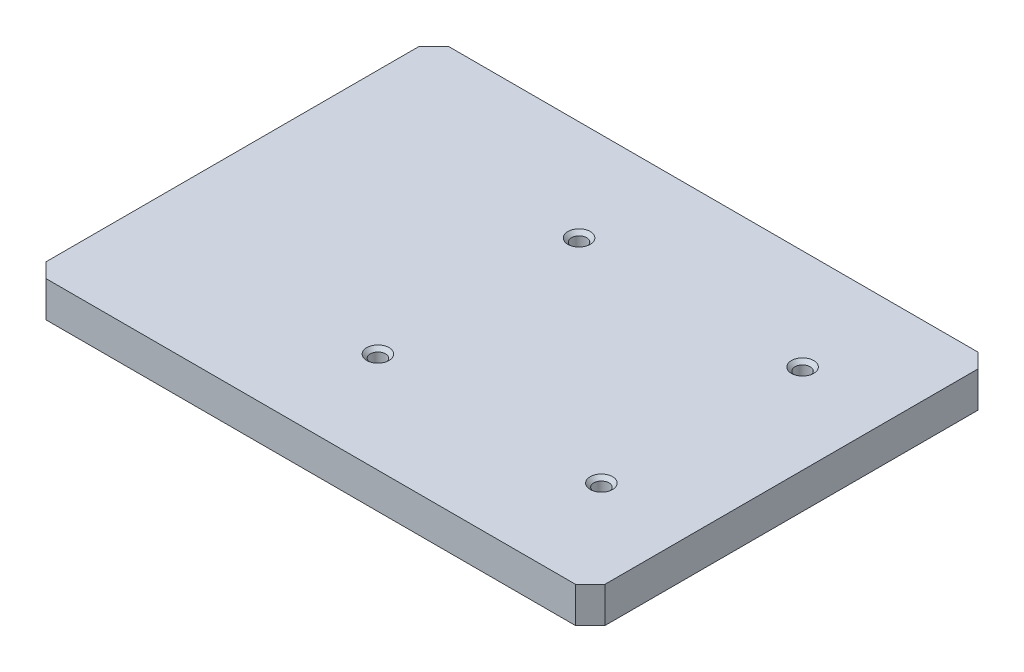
ISO-10303-21;
HEADER;
FILE_DESCRIPTION(('STEP AP214'),'2;1');
FILE_NAME('part.step','',(''),(''),'','','');
FILE_SCHEMA(('AUTOMOTIVE_DESIGN { 1 0 10303 214 1 1 1 1 }'));
ENDSEC;
DATA;
#1=APPLICATION_CONTEXT('core data for automotive mechanical design processes');
#2=APPLICATION_PROTOCOL_DEFINITION('international standard','automotive_design',2000,#1);
#3=PRODUCT_CONTEXT('',#1,'mechanical');
#4=PRODUCT('Part','Part','',(#3));
#5=PRODUCT_RELATED_PRODUCT_CATEGORY('part','',(#4));
#6=PRODUCT_DEFINITION_FORMATION('','',#4);
#7=PRODUCT_DEFINITION_CONTEXT('part definition',#1,'design');
#8=PRODUCT_DEFINITION('design','',#6,#7);
#9=PRODUCT_DEFINITION_SHAPE('','',#8);
#10=(LENGTH_UNIT() NAMED_UNIT(*) SI_UNIT(.MILLI.,.METRE.));
#11=(NAMED_UNIT(*) PLANE_ANGLE_UNIT() SI_UNIT($,.RADIAN.));
#12=(NAMED_UNIT(*) SI_UNIT($,.STERADIAN.) SOLID_ANGLE_UNIT());
#13=UNCERTAINTY_MEASURE_WITH_UNIT(LENGTH_MEASURE(1.E-05),#10,'distance_accuracy_value','');
#14=(GEOMETRIC_REPRESENTATION_CONTEXT(3) GLOBAL_UNCERTAINTY_ASSIGNED_CONTEXT((#13)) GLOBAL_UNIT_ASSIGNED_CONTEXT((#10,
#11,#12)) REPRESENTATION_CONTEXT('',''));
#15=CARTESIAN_POINT('',(0.,0.,0.));
#16=DIRECTION('',(0.,0.,1.));
#17=DIRECTION('',(1.,0.,0.));
#18=AXIS2_PLACEMENT_3D('',#15,#16,#17);
#19=CARTESIAN_POINT('',(-125.,16.,90.));
#20=DIRECTION('',(1.,0.,0.));
#21=DIRECTION('',(0.,0.,-1.));
#22=AXIS2_PLACEMENT_3D('',#19,#20,#21);
#23=PLANE('',#22);
#24=DIRECTION('',(0.,0.,1.));
#25=VECTOR('',#24,1.);
#26=CARTESIAN_POINT('',(-125.,16.,90.));
#27=LINE('',#26,#25);
#28=CARTESIAN_POINT('',(-125.,16.,-83.4999999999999));
#29=VERTEX_POINT('',#28);
#30=CARTESIAN_POINT('',(-125.,16.,83.5));
#31=VERTEX_POINT('',#30);
#32=EDGE_CURVE('E123',#29,#31,#27,.T.);
#33=ORIENTED_EDGE('',*,*,#32,.F.);
#34=DIRECTION('',(0.,-1.,0.));
#35=VECTOR('',#34,1.);
#36=CARTESIAN_POINT('',(-125.,16.,-83.5));
#37=LINE('',#36,#35);
#38=CARTESIAN_POINT('',(-125.,0.,-83.4999999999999));
#39=VERTEX_POINT('',#38);
#40=EDGE_CURVE('E108',#29,#39,#37,.T.);
#41=ORIENTED_EDGE('',*,*,#40,.T.);
#42=DIRECTION('',(0.,0.,1.));
#43=VECTOR('',#42,1.);
#44=CARTESIAN_POINT('',(-125.,0.,90.));
#45=LINE('',#44,#43);
#46=CARTESIAN_POINT('',(-125.,0.,83.5));
#47=VERTEX_POINT('',#46);
#48=EDGE_CURVE('E120',#39,#47,#45,.T.);
#49=ORIENTED_EDGE('',*,*,#48,.T.);
#50=DIRECTION('',(0.,1.,0.));
#51=VECTOR('',#50,1.);
#52=CARTESIAN_POINT('',(-125.,16.,83.5));
#53=LINE('',#52,#51);
#54=EDGE_CURVE('E125',#47,#31,#53,.T.);
#55=ORIENTED_EDGE('',*,*,#54,.T.);
#56=EDGE_LOOP('',(#33,#41,#49,#55));
#57=FACE_BOUND('',#56,.T.);
#58=ADVANCED_FACE('F39',(#57),#23,.F.);
#59=CARTESIAN_POINT('',(125.,16.,90.));
#60=DIRECTION('',(0.,0.,-1.));
#61=DIRECTION('',(-1.,0.,0.));
#62=AXIS2_PLACEMENT_3D('',#59,#60,#61);
#63=PLANE('',#62);
#64=DIRECTION('',(1.,0.,0.));
#65=VECTOR('',#64,1.);
#66=CARTESIAN_POINT('',(125.,16.,90.));
#67=LINE('',#66,#65);
#68=CARTESIAN_POINT('',(-118.5,16.,90.));
#69=VERTEX_POINT('',#68);
#70=CARTESIAN_POINT('',(118.5,16.,90.));
#71=VERTEX_POINT('',#70);
#72=EDGE_CURVE('E178',#69,#71,#67,.T.);
#73=ORIENTED_EDGE('',*,*,#72,.F.);
#74=DIRECTION('',(0.,-1.,0.));
#75=VECTOR('',#74,1.);
#76=CARTESIAN_POINT('',(-118.5,16.,90.));
#77=LINE('',#76,#75);
#78=CARTESIAN_POINT('',(-118.5,0.,90.));
#79=VERTEX_POINT('',#78);
#80=EDGE_CURVE('E162',#69,#79,#77,.T.);
#81=ORIENTED_EDGE('',*,*,#80,.T.);
#82=DIRECTION('',(1.,0.,0.));
#83=VECTOR('',#82,1.);
#84=CARTESIAN_POINT('',(125.,0.,90.));
#85=LINE('',#84,#83);
#86=CARTESIAN_POINT('',(118.5,0.,90.));
#87=VERTEX_POINT('',#86);
#88=EDGE_CURVE('E129',#79,#87,#85,.T.);
#89=ORIENTED_EDGE('',*,*,#88,.T.);
#90=DIRECTION('',(0.,1.,0.));
#91=VECTOR('',#90,1.);
#92=CARTESIAN_POINT('',(118.5,16.,90.));
#93=LINE('',#92,#91);
#94=EDGE_CURVE('E160',#87,#71,#93,.T.);
#95=ORIENTED_EDGE('',*,*,#94,.T.);
#96=EDGE_LOOP('',(#73,#81,#89,#95));
#97=FACE_BOUND('',#96,.T.);
#98=ADVANCED_FACE('F244',(#97),#63,.F.);
#99=CARTESIAN_POINT('',(125.,16.,90.));
#100=DIRECTION('',(-1.,0.,0.));
#101=DIRECTION('',(0.,0.,1.));
#102=AXIS2_PLACEMENT_3D('',#99,#100,#101);
#103=PLANE('',#102);
#104=DIRECTION('',(0.,0.,-1.));
#105=VECTOR('',#104,1.);
#106=CARTESIAN_POINT('',(125.,0.,90.));
#107=LINE('',#106,#105);
#108=CARTESIAN_POINT('',(125.,0.,83.4999999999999));
#109=VERTEX_POINT('',#108);
#110=CARTESIAN_POINT('',(125.,0.,-83.5));
#111=VERTEX_POINT('',#110);
#112=EDGE_CURVE('E133',#109,#111,#107,.T.);
#113=ORIENTED_EDGE('',*,*,#112,.T.);
#114=DIRECTION('',(0.,1.,0.));
#115=VECTOR('',#114,1.);
#116=CARTESIAN_POINT('',(125.,16.,-83.5));
#117=LINE('',#116,#115);
#118=CARTESIAN_POINT('',(125.,16.,-83.5));
#119=VERTEX_POINT('',#118);
#120=EDGE_CURVE('E11',#111,#119,#117,.T.);
#121=ORIENTED_EDGE('',*,*,#120,.T.);
#122=DIRECTION('',(0.,0.,-1.));
#123=VECTOR('',#122,1.);
#124=CARTESIAN_POINT('',(125.,16.,90.));
#125=LINE('',#124,#123);
#126=CARTESIAN_POINT('',(125.,16.,83.4999999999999));
#127=VERTEX_POINT('',#126);
#128=EDGE_CURVE('E168',#127,#119,#125,.T.);
#129=ORIENTED_EDGE('',*,*,#128,.F.);
#130=DIRECTION('',(0.,-1.,0.));
#131=VECTOR('',#130,1.);
#132=CARTESIAN_POINT('',(125.,16.,83.4999999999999));
#133=LINE('',#132,#131);
#134=EDGE_CURVE('E47',#127,#109,#133,.T.);
#135=ORIENTED_EDGE('',*,*,#134,.T.);
#136=EDGE_LOOP('',(#113,#121,#129,#135));
#137=FACE_BOUND('',#136,.T.);
#138=ADVANCED_FACE('F167',(#137),#103,.F.);
#139=CARTESIAN_POINT('',(125.,16.,-90.));
#140=DIRECTION('',(0.,0.,1.));
#141=DIRECTION('',(1.,0.,0.));
#142=AXIS2_PLACEMENT_3D('',#139,#140,#141);
#143=PLANE('',#142);
#144=DIRECTION('',(-1.,0.,0.));
#145=VECTOR('',#144,1.);
#146=CARTESIAN_POINT('',(125.,0.,-90.));
#147=LINE('',#146,#145);
#148=CARTESIAN_POINT('',(118.5,0.,-90.));
#149=VERTEX_POINT('',#148);
#150=CARTESIAN_POINT('',(-118.5,0.,-90.));
#151=VERTEX_POINT('',#150);
#152=EDGE_CURVE('E143',#149,#151,#147,.T.);
#153=ORIENTED_EDGE('',*,*,#152,.T.);
#154=DIRECTION('',(0.,1.,0.));
#155=VECTOR('',#154,1.);
#156=CARTESIAN_POINT('',(-118.5,16.,-90.));
#157=LINE('',#156,#155);
#158=CARTESIAN_POINT('',(-118.5,16.,-90.));
#159=VERTEX_POINT('',#158);
#160=EDGE_CURVE('E109',#151,#159,#157,.T.);
#161=ORIENTED_EDGE('',*,*,#160,.T.);
#162=DIRECTION('',(-1.,0.,0.));
#163=VECTOR('',#162,1.);
#164=CARTESIAN_POINT('',(125.,16.,-90.));
#165=LINE('',#164,#163);
#166=CARTESIAN_POINT('',(118.5,16.,-90.));
#167=VERTEX_POINT('',#166);
#168=EDGE_CURVE('E139',#167,#159,#165,.T.);
#169=ORIENTED_EDGE('',*,*,#168,.F.);
#170=DIRECTION('',(0.,-1.,0.));
#171=VECTOR('',#170,1.);
#172=CARTESIAN_POINT('',(118.5,16.,-90.));
#173=LINE('',#172,#171);
#174=EDGE_CURVE('E114',#167,#149,#173,.T.);
#175=ORIENTED_EDGE('',*,*,#174,.T.);
#176=EDGE_LOOP('',(#153,#161,#169,#175));
#177=FACE_BOUND('',#176,.T.);
#178=ADVANCED_FACE('F176',(#177),#143,.F.);
#179=CARTESIAN_POINT('',(0.,16.,0.));
#180=DIRECTION('',(0.,1.,0.));
#181=DIRECTION('',(0.,0.,1.));
#182=AXIS2_PLACEMENT_3D('',#179,#180,#181);
#183=PLANE('',#182);
#184=CARTESIAN_POINT('',(85.,16.,45.));
#185=DIRECTION('',(0.,1.,0.));
#186=DIRECTION('',(0.,0.,1.));
#187=AXIS2_PLACEMENT_3D('',#184,#185,#186);
#188=CIRCLE('',#187,5.);
#189=CARTESIAN_POINT('',(85.,16.,50.));
#190=VERTEX_POINT('',#189);
#191=EDGE_CURVE('E211',#190,#190,#188,.T.);
#192=ORIENTED_EDGE('',*,*,#191,.F.);
#193=EDGE_LOOP('',(#192));
#194=FACE_BOUND('',#193,.T.);
#195=CARTESIAN_POINT('',(-15.,16.,45.));
#196=DIRECTION('',(0.,1.,0.));
#197=DIRECTION('',(0.,0.,1.));
#198=AXIS2_PLACEMENT_3D('',#195,#196,#197);
#199=CIRCLE('',#198,5.);
#200=CARTESIAN_POINT('',(-15.,16.,50.));
#201=VERTEX_POINT('',#200);
#202=EDGE_CURVE('E202',#201,#201,#199,.T.);
#203=ORIENTED_EDGE('',*,*,#202,.F.);
#204=EDGE_LOOP('',(#203));
#205=FACE_BOUND('',#204,.T.);
#206=CARTESIAN_POINT('',(-15.,16.,-45.));
#207=DIRECTION('',(0.,1.,0.));
#208=DIRECTION('',(0.,0.,1.));
#209=AXIS2_PLACEMENT_3D('',#206,#207,#208);
#210=CIRCLE('',#209,5.);
#211=CARTESIAN_POINT('',(-15.,16.,-40.));
#212=VERTEX_POINT('',#211);
#213=EDGE_CURVE('E193',#212,#212,#210,.T.);
#214=ORIENTED_EDGE('',*,*,#213,.F.);
#215=EDGE_LOOP('',(#214));
#216=FACE_BOUND('',#215,.T.);
#217=CARTESIAN_POINT('',(85.,16.,-45.));
#218=DIRECTION('',(0.,1.,0.));
#219=DIRECTION('',(0.,0.,1.));
#220=AXIS2_PLACEMENT_3D('',#217,#218,#219);
#221=CIRCLE('',#220,5.);
#222=CARTESIAN_POINT('',(85.,16.,-40.));
#223=VERTEX_POINT('',#222);
#224=EDGE_CURVE('E184',#223,#223,#221,.T.);
#225=ORIENTED_EDGE('',*,*,#224,.F.);
#226=EDGE_LOOP('',(#225));
#227=FACE_BOUND('',#226,.T.);
#228=ORIENTED_EDGE('',*,*,#168,.T.);
#229=DIRECTION('',(0.707106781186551,0.,-0.707106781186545));
#230=VECTOR('',#229,1.);
#231=CARTESIAN_POINT('',(-104.249999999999,16.,-104.25));
#232=LINE('',#231,#230);
#233=EDGE_CURVE('E158',#159,#29,#232,.F.);
#234=ORIENTED_EDGE('',*,*,#233,.T.);
#235=ORIENTED_EDGE('',*,*,#32,.T.);
#236=DIRECTION('',(-0.707106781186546,0.,-0.707106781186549));
#237=VECTOR('',#236,1.);
#238=CARTESIAN_POINT('',(-104.25,16.,104.25));
#239=LINE('',#238,#237);
#240=EDGE_CURVE('E156',#31,#69,#239,.F.);
#241=ORIENTED_EDGE('',*,*,#240,.T.);
#242=ORIENTED_EDGE('',*,*,#72,.T.);
#243=DIRECTION('',(-0.707106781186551,0.,0.707106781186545));
#244=VECTOR('',#243,1.);
#245=CARTESIAN_POINT('',(104.249999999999,16.,104.25));
#246=LINE('',#245,#244);
#247=EDGE_CURVE('E59',#71,#127,#246,.F.);
#248=ORIENTED_EDGE('',*,*,#247,.T.);
#249=ORIENTED_EDGE('',*,*,#128,.T.);
#250=DIRECTION('',(0.707106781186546,0.,0.707106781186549));
#251=VECTOR('',#250,1.);
#252=CARTESIAN_POINT('',(104.25,16.,-104.25));
#253=LINE('',#252,#251);
#254=EDGE_CURVE('E154',#119,#167,#253,.F.);
#255=ORIENTED_EDGE('',*,*,#254,.T.);
#256=EDGE_LOOP('',(#228,#234,#235,#241,#242,#248,#249,#255));
#257=FACE_BOUND('',#256,.T.);
#258=ADVANCED_FACE('F217',(#194,#205,#216,#227,#257),#183,.T.);
#259=CARTESIAN_POINT('',(0.,0.,0.));
#260=DIRECTION('',(0.,1.,0.));
#261=DIRECTION('',(0.,0.,1.));
#262=AXIS2_PLACEMENT_3D('',#259,#260,#261);
#263=PLANE('',#262);
#264=CARTESIAN_POINT('',(85.,0.,45.));
#265=DIRECTION('',(0.,1.,0.));
#266=DIRECTION('',(0.,0.,1.));
#267=AXIS2_PLACEMENT_3D('',#264,#265,#266);
#268=CIRCLE('',#267,3.4);
#269=CARTESIAN_POINT('',(85.,0.,48.4));
#270=VERTEX_POINT('',#269);
#271=EDGE_CURVE('E205',#270,#270,#268,.T.);
#272=ORIENTED_EDGE('',*,*,#271,.T.);
#273=EDGE_LOOP('',(#272));
#274=FACE_BOUND('',#273,.T.);
#275=CARTESIAN_POINT('',(-15.,0.,45.));
#276=DIRECTION('',(0.,1.,0.));
#277=DIRECTION('',(0.,0.,1.));
#278=AXIS2_PLACEMENT_3D('',#275,#276,#277);
#279=CIRCLE('',#278,3.4);
#280=CARTESIAN_POINT('',(-15.,0.,48.4));
#281=VERTEX_POINT('',#280);
#282=EDGE_CURVE('E196',#281,#281,#279,.T.);
#283=ORIENTED_EDGE('',*,*,#282,.T.);
#284=EDGE_LOOP('',(#283));
#285=FACE_BOUND('',#284,.T.);
#286=CARTESIAN_POINT('',(-15.,0.,-45.));
#287=DIRECTION('',(0.,1.,0.));
#288=DIRECTION('',(0.,0.,1.));
#289=AXIS2_PLACEMENT_3D('',#286,#287,#288);
#290=CIRCLE('',#289,3.4);
#291=CARTESIAN_POINT('',(-15.,0.,-41.6));
#292=VERTEX_POINT('',#291);
#293=EDGE_CURVE('E187',#292,#292,#290,.T.);
#294=ORIENTED_EDGE('',*,*,#293,.T.);
#295=EDGE_LOOP('',(#294));
#296=FACE_BOUND('',#295,.T.);
#297=CARTESIAN_POINT('',(85.,0.,-45.));
#298=DIRECTION('',(0.,1.,0.));
#299=DIRECTION('',(0.,0.,1.));
#300=AXIS2_PLACEMENT_3D('',#297,#298,#299);
#301=CIRCLE('',#300,3.4);
#302=CARTESIAN_POINT('',(85.,0.,-41.6));
#303=VERTEX_POINT('',#302);
#304=EDGE_CURVE('E130',#303,#303,#301,.T.);
#305=ORIENTED_EDGE('',*,*,#304,.T.);
#306=EDGE_LOOP('',(#305));
#307=FACE_BOUND('',#306,.T.);
#308=ORIENTED_EDGE('',*,*,#48,.F.);
#309=DIRECTION('',(-0.707106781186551,0.,0.707106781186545));
#310=VECTOR('',#309,1.);
#311=CARTESIAN_POINT('',(-125.,0.,-83.5));
#312=LINE('',#311,#310);
#313=EDGE_CURVE('E104',#39,#151,#312,.F.);
#314=ORIENTED_EDGE('',*,*,#313,.T.);
#315=ORIENTED_EDGE('',*,*,#152,.F.);
#316=DIRECTION('',(-0.707106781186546,0.,-0.707106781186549));
#317=VECTOR('',#316,1.);
#318=CARTESIAN_POINT('',(118.5,0.,-90.));
#319=LINE('',#318,#317);
#320=EDGE_CURVE('E147',#149,#111,#319,.F.);
#321=ORIENTED_EDGE('',*,*,#320,.T.);
#322=ORIENTED_EDGE('',*,*,#112,.F.);
#323=DIRECTION('',(0.707106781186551,0.,-0.707106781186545));
#324=VECTOR('',#323,1.);
#325=CARTESIAN_POINT('',(125.,0.,83.4999999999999));
#326=LINE('',#325,#324);
#327=EDGE_CURVE('E124',#109,#87,#326,.F.);
#328=ORIENTED_EDGE('',*,*,#327,.T.);
#329=ORIENTED_EDGE('',*,*,#88,.F.);
#330=DIRECTION('',(0.707106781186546,0.,0.707106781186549));
#331=VECTOR('',#330,1.);
#332=CARTESIAN_POINT('',(-118.5,0.,90.));
#333=LINE('',#332,#331);
#334=EDGE_CURVE('E115',#79,#47,#333,.F.);
#335=ORIENTED_EDGE('',*,*,#334,.T.);
#336=EDGE_LOOP('',(#308,#314,#315,#321,#322,#328,#329,#335));
#337=FACE_BOUND('',#336,.T.);
#338=ADVANCED_FACE('F127',(#274,#285,#296,#307,#337),#263,.F.);
#339=CARTESIAN_POINT('',(85.,16.,-45.));
#340=DIRECTION('',(0.,1.,0.));
#341=DIRECTION('',(0.,0.,1.));
#342=AXIS2_PLACEMENT_3D('',#339,#340,#341);
#343=CYLINDRICAL_SURFACE('',#342,3.39999999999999);
#344=ORIENTED_EDGE('',*,*,#304,.F.);
#345=EDGE_LOOP('',(#344));
#346=FACE_BOUND('',#345,.T.);
#347=CARTESIAN_POINT('',(85.,14.4,-45.));
#348=DIRECTION('',(0.,1.,0.));
#349=DIRECTION('',(0.,0.,1.));
#350=AXIS2_PLACEMENT_3D('',#347,#348,#349);
#351=CIRCLE('',#350,3.39999999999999);
#352=CARTESIAN_POINT('',(85.,14.4,-41.6));
#353=VERTEX_POINT('',#352);
#354=EDGE_CURVE('E136',#353,#353,#351,.T.);
#355=ORIENTED_EDGE('',*,*,#354,.T.);
#356=EDGE_LOOP('',(#355));
#357=FACE_BOUND('',#356,.T.);
#358=ADVANCED_FACE('F230',(#346,#357),#343,.F.);
#359=CARTESIAN_POINT('',(85.,16.,-45.));
#360=DIRECTION('',(0.,1.,0.));
#361=DIRECTION('',(0.,0.,1.));
#362=AXIS2_PLACEMENT_3D('',#359,#360,#361);
#363=CONICAL_SURFACE('',#362,5.,0.78539816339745);
#364=ORIENTED_EDGE('',*,*,#354,.F.);
#365=EDGE_LOOP('',(#364));
#366=FACE_BOUND('',#365,.T.);
#367=ORIENTED_EDGE('',*,*,#224,.T.);
#368=EDGE_LOOP('',(#367));
#369=FACE_BOUND('',#368,.T.);
#370=ADVANCED_FACE('F227',(#366,#369),#363,.F.);
#371=CARTESIAN_POINT('',(-15.,16.,-45.));
#372=DIRECTION('',(0.,1.,0.));
#373=DIRECTION('',(0.,0.,1.));
#374=AXIS2_PLACEMENT_3D('',#371,#372,#373);
#375=CYLINDRICAL_SURFACE('',#374,3.39999999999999);
#376=ORIENTED_EDGE('',*,*,#293,.F.);
#377=EDGE_LOOP('',(#376));
#378=FACE_BOUND('',#377,.T.);
#379=CARTESIAN_POINT('',(-15.,14.4,-45.));
#380=DIRECTION('',(0.,1.,0.));
#381=DIRECTION('',(0.,0.,1.));
#382=AXIS2_PLACEMENT_3D('',#379,#380,#381);
#383=CIRCLE('',#382,3.39999999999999);
#384=CARTESIAN_POINT('',(-15.,14.4,-41.6));
#385=VERTEX_POINT('',#384);
#386=EDGE_CURVE('E190',#385,#385,#383,.T.);
#387=ORIENTED_EDGE('',*,*,#386,.T.);
#388=EDGE_LOOP('',(#387));
#389=FACE_BOUND('',#388,.T.);
#390=ADVANCED_FACE('F229',(#378,#389),#375,.F.);
#391=CARTESIAN_POINT('',(-15.,16.,-45.));
#392=DIRECTION('',(0.,1.,0.));
#393=DIRECTION('',(0.,0.,1.));
#394=AXIS2_PLACEMENT_3D('',#391,#392,#393);
#395=CONICAL_SURFACE('',#394,5.,0.785398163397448);
#396=ORIENTED_EDGE('',*,*,#386,.F.);
#397=EDGE_LOOP('',(#396));
#398=FACE_BOUND('',#397,.T.);
#399=ORIENTED_EDGE('',*,*,#213,.T.);
#400=EDGE_LOOP('',(#399));
#401=FACE_BOUND('',#400,.T.);
#402=ADVANCED_FACE('F237',(#398,#401),#395,.F.);
#403=CARTESIAN_POINT('',(-15.,16.,45.));
#404=DIRECTION('',(0.,1.,0.));
#405=DIRECTION('',(0.,0.,1.));
#406=AXIS2_PLACEMENT_3D('',#403,#404,#405);
#407=CYLINDRICAL_SURFACE('',#406,3.39999999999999);
#408=ORIENTED_EDGE('',*,*,#282,.F.);
#409=EDGE_LOOP('',(#408));
#410=FACE_BOUND('',#409,.T.);
#411=CARTESIAN_POINT('',(-15.,14.4,45.));
#412=DIRECTION('',(0.,1.,0.));
#413=DIRECTION('',(0.,0.,1.));
#414=AXIS2_PLACEMENT_3D('',#411,#412,#413);
#415=CIRCLE('',#414,3.39999999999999);
#416=CARTESIAN_POINT('',(-15.,14.4,48.4));
#417=VERTEX_POINT('',#416);
#418=EDGE_CURVE('E199',#417,#417,#415,.T.);
#419=ORIENTED_EDGE('',*,*,#418,.T.);
#420=EDGE_LOOP('',(#419));
#421=FACE_BOUND('',#420,.T.);
#422=ADVANCED_FACE('F356',(#410,#421),#407,.F.);
#423=CARTESIAN_POINT('',(-15.,16.,45.));
#424=DIRECTION('',(0.,1.,0.));
#425=DIRECTION('',(0.,0.,1.));
#426=AXIS2_PLACEMENT_3D('',#423,#424,#425);
#427=CONICAL_SURFACE('',#426,5.,0.785398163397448);
#428=ORIENTED_EDGE('',*,*,#418,.F.);
#429=EDGE_LOOP('',(#428));
#430=FACE_BOUND('',#429,.T.);
#431=ORIENTED_EDGE('',*,*,#202,.T.);
#432=EDGE_LOOP('',(#431));
#433=FACE_BOUND('',#432,.T.);
#434=ADVANCED_FACE('F345',(#430,#433),#427,.F.);
#435=CARTESIAN_POINT('',(85.,16.,45.));
#436=DIRECTION('',(0.,1.,0.));
#437=DIRECTION('',(0.,0.,1.));
#438=AXIS2_PLACEMENT_3D('',#435,#436,#437);
#439=CYLINDRICAL_SURFACE('',#438,3.39999999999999);
#440=ORIENTED_EDGE('',*,*,#271,.F.);
#441=EDGE_LOOP('',(#440));
#442=FACE_BOUND('',#441,.T.);
#443=CARTESIAN_POINT('',(85.,14.4,45.));
#444=DIRECTION('',(0.,1.,0.));
#445=DIRECTION('',(0.,0.,1.));
#446=AXIS2_PLACEMENT_3D('',#443,#444,#445);
#447=CIRCLE('',#446,3.39999999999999);
#448=CARTESIAN_POINT('',(85.,14.4,48.4));
#449=VERTEX_POINT('',#448);
#450=EDGE_CURVE('E208',#449,#449,#447,.T.);
#451=ORIENTED_EDGE('',*,*,#450,.T.);
#452=EDGE_LOOP('',(#451));
#453=FACE_BOUND('',#452,.T.);
#454=ADVANCED_FACE('F334',(#442,#453),#439,.F.);
#455=CARTESIAN_POINT('',(85.,16.,45.));
#456=DIRECTION('',(0.,1.,0.));
#457=DIRECTION('',(0.,0.,1.));
#458=AXIS2_PLACEMENT_3D('',#455,#456,#457);
#459=CONICAL_SURFACE('',#458,5.,0.78539816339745);
#460=ORIENTED_EDGE('',*,*,#450,.F.);
#461=EDGE_LOOP('',(#460));
#462=FACE_BOUND('',#461,.T.);
#463=ORIENTED_EDGE('',*,*,#191,.T.);
#464=EDGE_LOOP('',(#463));
#465=FACE_BOUND('',#464,.T.);
#466=ADVANCED_FACE('F215',(#462,#465),#459,.F.);
#467=CARTESIAN_POINT('',(-125.,16.,-83.5));
#468=DIRECTION('',(0.707106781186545,0.,0.707106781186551));
#469=DIRECTION('',(0.,-1.,0.));
#470=AXIS2_PLACEMENT_3D('',#467,#468,#469);
#471=PLANE('',#470);
#472=ORIENTED_EDGE('',*,*,#233,.F.);
#473=ORIENTED_EDGE('',*,*,#160,.F.);
#474=ORIENTED_EDGE('',*,*,#313,.F.);
#475=ORIENTED_EDGE('',*,*,#40,.F.);
#476=EDGE_LOOP('',(#472,#473,#474,#475));
#477=FACE_BOUND('',#476,.T.);
#478=ADVANCED_FACE('F107',(#477),#471,.F.);
#479=CARTESIAN_POINT('',(-118.5,16.,90.));
#480=DIRECTION('',(0.707106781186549,0.,-0.707106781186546));
#481=DIRECTION('',(0.,-1.,0.));
#482=AXIS2_PLACEMENT_3D('',#479,#480,#481);
#483=PLANE('',#482);
#484=ORIENTED_EDGE('',*,*,#240,.F.);
#485=ORIENTED_EDGE('',*,*,#54,.F.);
#486=ORIENTED_EDGE('',*,*,#334,.F.);
#487=ORIENTED_EDGE('',*,*,#80,.F.);
#488=EDGE_LOOP('',(#484,#485,#486,#487));
#489=FACE_BOUND('',#488,.T.);
#490=ADVANCED_FACE('F255',(#489),#483,.F.);
#491=CARTESIAN_POINT('',(118.5,16.,-90.));
#492=DIRECTION('',(-0.707106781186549,0.,0.707106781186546));
#493=DIRECTION('',(0.,-1.,0.));
#494=AXIS2_PLACEMENT_3D('',#491,#492,#493);
#495=PLANE('',#494);
#496=ORIENTED_EDGE('',*,*,#254,.F.);
#497=ORIENTED_EDGE('',*,*,#120,.F.);
#498=ORIENTED_EDGE('',*,*,#320,.F.);
#499=ORIENTED_EDGE('',*,*,#174,.F.);
#500=EDGE_LOOP('',(#496,#497,#498,#499));
#501=FACE_BOUND('',#500,.T.);
#502=ADVANCED_FACE('F173',(#501),#495,.F.);
#503=CARTESIAN_POINT('',(125.,16.,83.4999999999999));
#504=DIRECTION('',(-0.707106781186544,0.,-0.70710678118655));
#505=DIRECTION('',(0.,-1.,0.));
#506=AXIS2_PLACEMENT_3D('',#503,#504,#505);
#507=PLANE('',#506);
#508=ORIENTED_EDGE('',*,*,#247,.F.);
#509=ORIENTED_EDGE('',*,*,#94,.F.);
#510=ORIENTED_EDGE('',*,*,#327,.F.);
#511=ORIENTED_EDGE('',*,*,#134,.F.);
#512=EDGE_LOOP('',(#508,#509,#510,#511));
#513=FACE_BOUND('',#512,.T.);
#514=ADVANCED_FACE('F41',(#513),#507,.F.);
#515=CLOSED_SHELL('',(#58,#98,#138,#178,#258,#338,#358,#370,#390,#402,#422,#434,#454,#466,#478,
#490,#502,#514));
#516=MANIFOLD_SOLID_BREP('B2',#515);
#517=ADVANCED_BREP_SHAPE_REPRESENTATION('',(#18,#516),#14);
#518=SHAPE_DEFINITION_REPRESENTATION(#9,#517);
ENDSEC;
END-ISO-10303-21;
